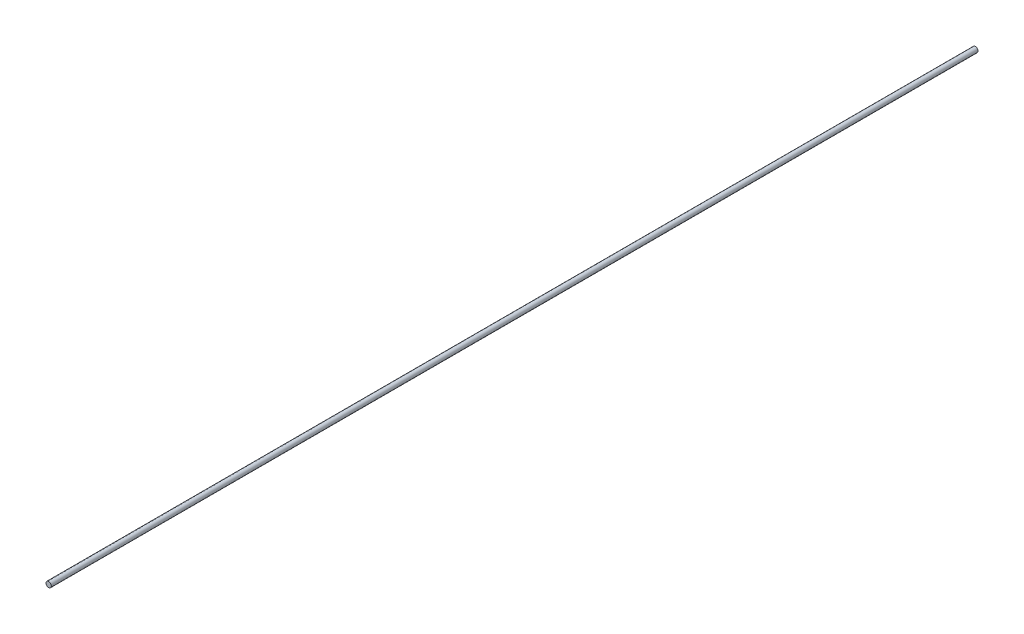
from build123d import *

# Parameters (mm, degrees)
ESQUISSE1_R      = 2
EXTRUSION1_DEPTH = 700


with BuildPart() as part:
    # Esquisse1 → Extrusion1 (new body)
    with BuildSketch(Plane.XY):
        Circle(ESQUISSE1_R)
    extrude(amount=EXTRUSION1_DEPTH)


solid = part.part
